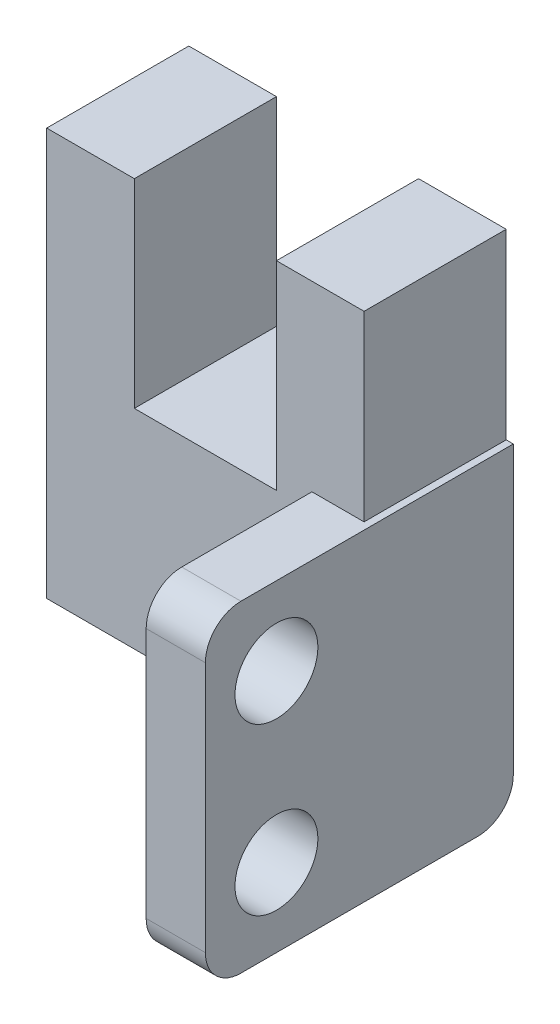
from build123d import *

# Parameters (mm, degrees)
EXTRUDE_1_DEPTH     = 6
EXTRUDE_2_DEPTH     = 2.5
SKETCH_3_W          = 13
SKETCH_3_H          = 13.6
EXTRUDE_3_DEPTH     = 0.3
SKETCH_4_R          = 1.75
CUT_EXTRUDE_1_DEPTH = 2.8
CUT_EXTRUDE_2_DEPTH = 0.3
SKETCH_6_R          = 1.25
EXTRUDE_4_DEPTH     = 10
FILLET_2_R          = 1.5


with BuildPart() as part:
    # Sketch 1 → Extrude 1 (new body)
    with BuildSketch(Plane.XY):
        Polygon((0, 0), (0, 17.2), (3.7, 17.2), (3.7, 8.8), (9.7, 8.8), (9.7, 17.2), (13.4, 17.2), (13.4, 0), align=None)
    extrude(amount=EXTRUDE_1_DEPTH)

    # Sketch 2 → Extrude 2 (add)
    with BuildSketch(Plane(origin=(13.4, 0, 0), x_dir=(0, 0, -1), z_dir=(1, 0, 0))):
        Polygon((0, 0), (0, -4.1), (-13, -4.1), (-13, 9.5), (0, 9.5), align=None)
    extrude(amount=-EXTRUDE_2_DEPTH)

    # Sketch 3 → Extrude 3 (add)
    with BuildSketch(Plane(origin=(13.4, 0, 0), x_dir=(0, 0, -1), z_dir=(1, 0, 0))):
        with Locations((-6.5, 2.7)):
            Rectangle(SKETCH_3_W, SKETCH_3_H)
    extrude(amount=EXTRUDE_3_DEPTH)

    # Sketch 4 → Cut-Extrude 1 (cut)
    with BuildSketch(Plane(origin=(13.7, 0, 0), x_dir=(0, 0, -1), z_dir=(1, 0, 0))):
        with Locations((-10, 6.2)):
            Circle(SKETCH_4_R)
        with Locations((-10, -0.8)):
            Circle(SKETCH_4_R)
    extrude(amount=-CUT_EXTRUDE_1_DEPTH, mode=Mode.SUBTRACT)

    # Sketch 5 → Cut-Extrude 2 (cut)
    with BuildSketch(Plane.ZY.offset(-10.9)):
        Polygon((0, -4.1), (13, -4.1), (13, 9.5), (6, 9.5), (6, 0), (0, 0), align=None)
    extrude(amount=-CUT_EXTRUDE_2_DEPTH, mode=Mode.SUBTRACT)

    # Sketch 6 → Extrude 4 (add)
    with BuildSketch(Plane(origin=(0, 0, 0), x_dir=(-1, 0, 0), z_dir=(0, -1, 0))):
        with Locations(Location((-5.6, -3, 0), (0, 0, 270))):
            Circle(SKETCH_6_R)
    extrude(amount=EXTRUDE_4_DEPTH)

    # Fillet 2
    fillet_2_edges = [part.edges().sort_by_distance(p)[0] for p in [
        (12.45, -4.1, 13),
        (12.45, 9.5, 13),
        (12.45, -4.1, 0),
    ]]
    fillet(fillet_2_edges, radius=FILLET_2_R)


solid = part.part
